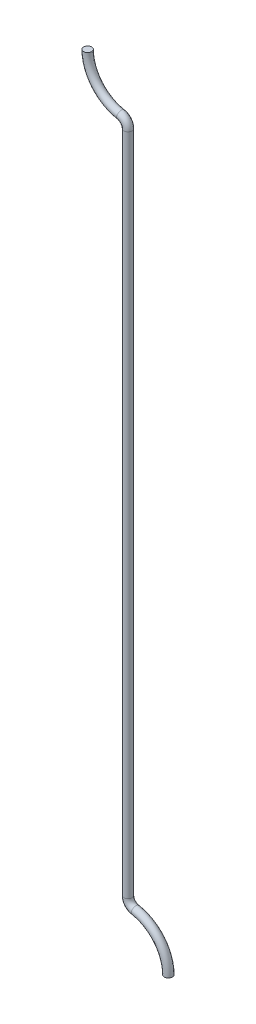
from build123d import *

# Parameters (mm, degrees)
ESQUISSE3_R = 0.9


with BuildPart() as part:
    # Balayage2: sweep along a path in Esquisse1
    with BuildLine(Plane.XY) as balayage2_path:
        ThreePointArc((-9.117592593, 84.855), (-7.035947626, 79.098580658), (-1.753956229, 76.005010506))
        ThreePointArc((-1.753956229, 76.005010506), (-0.580180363, 75.317550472), (-0.117592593, 74.038346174))
        Line((-0.117592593, 74.038346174), (-0.117592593, 0))
        Line((-0.117592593, 0), (-0.117592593, -74.038346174))
        ThreePointArc((-0.117592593, -74.038346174), (0.344995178, -75.317550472), (1.518771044, -76.005010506))
        ThreePointArc((1.518771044, -76.005010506), (6.80076244, -79.098580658), (8.882407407, -84.855))
    # Esquisse3 → Balayage2 (sweep)
    with BuildSketch(Plane(origin=(0, 84.855, 0), x_dir=(-1, 0, 0), z_dir=(0, 1, 0))):
        with Locations((9.117592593, 0)):
            Circle(ESQUISSE3_R)
    sweep(path=balayage2_path.line)


solid = part.part
